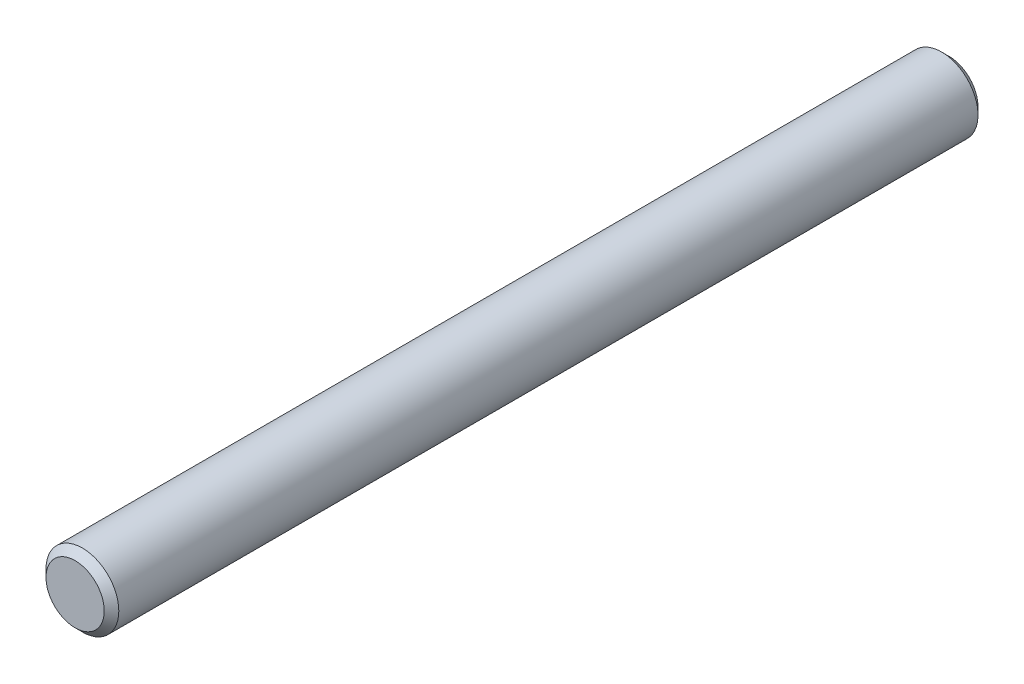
from build123d import *

# Parameters (mm, degrees)
ESQUISSE1_W = 5
ESQUISSE1_H = 120
CHANF1_SIZE = 1


with BuildPart() as part:
    # Esquisse1 → Tige (revolve)
    with BuildSketch(Plane(origin=(0, 0, 0), x_dir=(1, 0, 0), z_dir=(0, 1, 0))):
        with Locations((-2.5, 60)):
            Rectangle(ESQUISSE1_W, ESQUISSE1_H)
    revolve(axis=Axis((0, 0, -83.091950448), (0, 0, 1)))

    # Chanf1
    chanf1_edges = [part.edges().sort_by_distance(p)[0] for p in [
        (5, 0, -120),
        (5, 0, 0),
    ]]
    chamfer(chanf1_edges, length=CHANF1_SIZE)


solid = part.part
